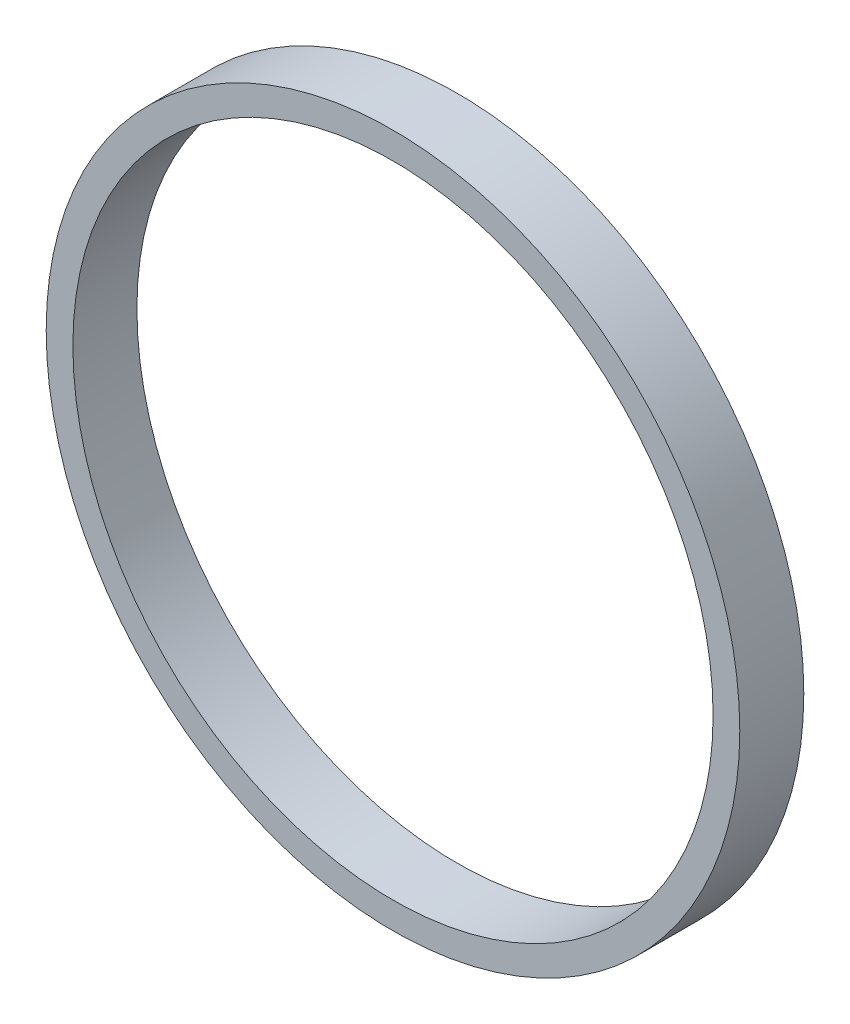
from build123d import *

# Parameters (mm, degrees)
SKETCH1_R           = 32.5
SKETCH1_R_2         = 30
BOSS_EXTRUDE1_DEPTH = 3


with BuildPart() as part:
    # Sketch1 → Boss-Extrude1 (new, symmetric)
    with BuildSketch(Plane.XY):
        Circle(SKETCH1_R)
        Circle(SKETCH1_R_2, mode=Mode.SUBTRACT)
    extrude(amount=BOSS_EXTRUDE1_DEPTH, both=True)


solid = part.part
